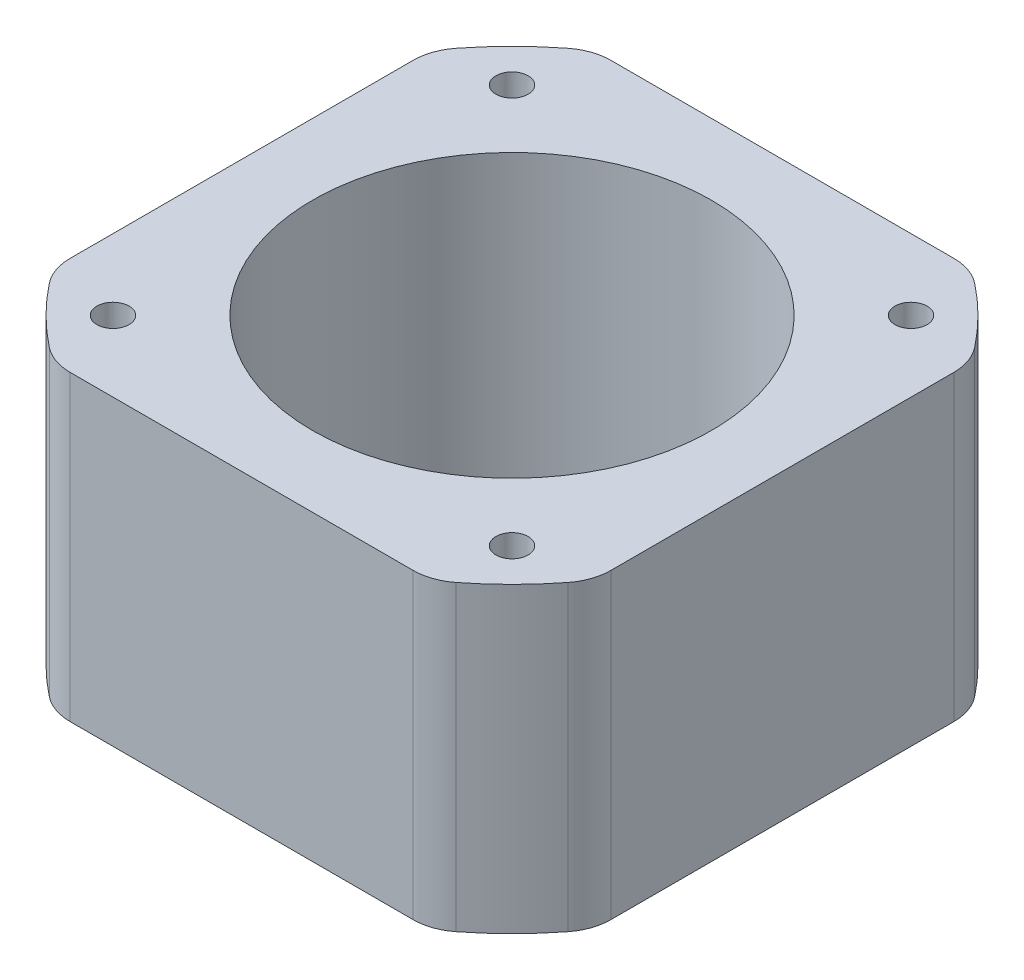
ISO-10303-21;
HEADER;
FILE_DESCRIPTION(('STEP AP214'),'2;1');
FILE_NAME('part.step','',(''),(''),'','','');
FILE_SCHEMA(('AUTOMOTIVE_DESIGN { 1 0 10303 214 1 1 1 1 }'));
ENDSEC;
DATA;
#1=APPLICATION_CONTEXT('core data for automotive mechanical design processes');
#2=APPLICATION_PROTOCOL_DEFINITION('international standard','automotive_design',2000,#1);
#3=PRODUCT_CONTEXT('',#1,'mechanical');
#4=PRODUCT('Part','Part','',(#3));
#5=PRODUCT_RELATED_PRODUCT_CATEGORY('part','',(#4));
#6=PRODUCT_DEFINITION_FORMATION('','',#4);
#7=PRODUCT_DEFINITION_CONTEXT('part definition',#1,'design');
#8=PRODUCT_DEFINITION('design','',#6,#7);
#9=PRODUCT_DEFINITION_SHAPE('','',#8);
#10=(LENGTH_UNIT() NAMED_UNIT(*) SI_UNIT(.MILLI.,.METRE.));
#11=(NAMED_UNIT(*) PLANE_ANGLE_UNIT() SI_UNIT($,.RADIAN.));
#12=(NAMED_UNIT(*) SI_UNIT($,.STERADIAN.) SOLID_ANGLE_UNIT());
#13=UNCERTAINTY_MEASURE_WITH_UNIT(LENGTH_MEASURE(1.E-05),#10,'distance_accuracy_value','');
#14=(GEOMETRIC_REPRESENTATION_CONTEXT(3) GLOBAL_UNCERTAINTY_ASSIGNED_CONTEXT((#13)) GLOBAL_UNIT_ASSIGNED_CONTEXT((#10,
#11,#12)) REPRESENTATION_CONTEXT('',''));
#15=CARTESIAN_POINT('',(0.,0.,0.));
#16=DIRECTION('',(0.,0.,1.));
#17=DIRECTION('',(1.,0.,0.));
#18=AXIS2_PLACEMENT_3D('',#15,#16,#17);
#19=CARTESIAN_POINT('',(0.,23.5,0.));
#20=DIRECTION('',(0.,1.,0.));
#21=DIRECTION('',(0.,0.,1.));
#22=AXIS2_PLACEMENT_3D('',#19,#20,#21);
#23=PLANE('',#22);
#24=CARTESIAN_POINT('',(15.5,23.5,15.5));
#25=DIRECTION('',(0.,1.,0.));
#26=DIRECTION('',(0.,0.,1.));
#27=AXIS2_PLACEMENT_3D('',#24,#25,#26);
#28=CIRCLE('',#27,1.25000000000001);
#29=CARTESIAN_POINT('',(15.5,23.5,16.75));
#30=VERTEX_POINT('',#29);
#31=EDGE_CURVE('E319',#30,#30,#28,.T.);
#32=ORIENTED_EDGE('',*,*,#31,.F.);
#33=EDGE_LOOP('',(#32));
#34=FACE_BOUND('',#33,.T.);
#35=CARTESIAN_POINT('',(-15.5,23.5,-15.5));
#36=DIRECTION('',(0.,1.,0.));
#37=DIRECTION('',(0.,0.,1.));
#38=AXIS2_PLACEMENT_3D('',#35,#36,#37);
#39=CIRCLE('',#38,1.25000000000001);
#40=CARTESIAN_POINT('',(-15.5,23.5,-14.25));
#41=VERTEX_POINT('',#40);
#42=EDGE_CURVE('E307',#41,#41,#39,.T.);
#43=ORIENTED_EDGE('',*,*,#42,.F.);
#44=EDGE_LOOP('',(#43));
#45=FACE_BOUND('',#44,.T.);
#46=CARTESIAN_POINT('',(0.,23.5,0.));
#47=DIRECTION('',(0.,1.,0.));
#48=DIRECTION('',(0.,0.,1.));
#49=AXIS2_PLACEMENT_3D('',#46,#47,#48);
#50=CIRCLE('',#49,25.6);
#51=CARTESIAN_POINT('',(-15.7927871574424,23.5,-20.1481481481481));
#52=VERTEX_POINT('',#51);
#53=CARTESIAN_POINT('',(-20.1481481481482,23.5,-15.7927871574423));
#54=VERTEX_POINT('',#53);
#55=EDGE_CURVE('E295',#52,#54,#50,.T.);
#56=ORIENTED_EDGE('',*,*,#55,.T.);
#57=CARTESIAN_POINT('',(-17.,23.5,-13.325164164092));
#58=DIRECTION('',(0.,1.,0.));
#59=DIRECTION('',(0.,0.,1.));
#60=AXIS2_PLACEMENT_3D('',#57,#58,#59);
#61=CIRCLE('',#60,4.);
#62=CARTESIAN_POINT('',(-21.,23.5,-13.325164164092));
#63=VERTEX_POINT('',#62);
#64=EDGE_CURVE('E223',#54,#63,#61,.T.);
#65=ORIENTED_EDGE('',*,*,#64,.T.);
#66=DIRECTION('',(0.,0.,1.));
#67=VECTOR('',#66,1.);
#68=CARTESIAN_POINT('',(-21.,23.5,14.641038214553));
#69=LINE('',#68,#67);
#70=CARTESIAN_POINT('',(-21.,23.5,13.325164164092));
#71=VERTEX_POINT('',#70);
#72=EDGE_CURVE('E168',#63,#71,#69,.T.);
#73=ORIENTED_EDGE('',*,*,#72,.T.);
#74=CARTESIAN_POINT('',(-17.,23.5,13.325164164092));
#75=DIRECTION('',(0.,1.,0.));
#76=DIRECTION('',(0.,0.,1.));
#77=AXIS2_PLACEMENT_3D('',#74,#75,#76);
#78=CIRCLE('',#77,4.);
#79=CARTESIAN_POINT('',(-20.1481481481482,23.5,15.7927871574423));
#80=VERTEX_POINT('',#79);
#81=EDGE_CURVE('E210',#71,#80,#78,.T.);
#82=ORIENTED_EDGE('',*,*,#81,.T.);
#83=CARTESIAN_POINT('',(0.,23.5,0.));
#84=DIRECTION('',(0.,1.,0.));
#85=DIRECTION('',(0.,0.,1.));
#86=AXIS2_PLACEMENT_3D('',#83,#84,#85);
#87=CIRCLE('',#86,25.6);
#88=CARTESIAN_POINT('',(-15.7927871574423,23.5,20.1481481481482));
#89=VERTEX_POINT('',#88);
#90=EDGE_CURVE('E255',#80,#89,#87,.T.);
#91=ORIENTED_EDGE('',*,*,#90,.T.);
#92=CARTESIAN_POINT('',(-13.325164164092,23.5,17.));
#93=DIRECTION('',(0.,1.,0.));
#94=DIRECTION('',(0.,0.,1.));
#95=AXIS2_PLACEMENT_3D('',#92,#93,#94);
#96=CIRCLE('',#95,4.);
#97=CARTESIAN_POINT('',(-13.325164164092,23.5,21.));
#98=VERTEX_POINT('',#97);
#99=EDGE_CURVE('E212',#89,#98,#96,.T.);
#100=ORIENTED_EDGE('',*,*,#99,.T.);
#101=DIRECTION('',(1.,0.,0.));
#102=VECTOR('',#101,1.);
#103=CARTESIAN_POINT('',(-14.641038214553,23.5,21.));
#104=LINE('',#103,#102);
#105=CARTESIAN_POINT('',(13.3251641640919,23.5,21.));
#106=VERTEX_POINT('',#105);
#107=EDGE_CURVE('E268',#98,#106,#104,.T.);
#108=ORIENTED_EDGE('',*,*,#107,.T.);
#109=CARTESIAN_POINT('',(13.3251641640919,23.5,17.));
#110=DIRECTION('',(0.,1.,0.));
#111=DIRECTION('',(0.,0.,1.));
#112=AXIS2_PLACEMENT_3D('',#109,#110,#111);
#113=CIRCLE('',#112,4.);
#114=CARTESIAN_POINT('',(15.7927871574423,23.5,20.1481481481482));
#115=VERTEX_POINT('',#114);
#116=EDGE_CURVE('E214',#106,#115,#113,.T.);
#117=ORIENTED_EDGE('',*,*,#116,.T.);
#118=CARTESIAN_POINT('',(0.,23.5,0.));
#119=DIRECTION('',(0.,1.,0.));
#120=DIRECTION('',(0.,0.,1.));
#121=AXIS2_PLACEMENT_3D('',#118,#119,#120);
#122=CIRCLE('',#121,25.6);
#123=CARTESIAN_POINT('',(20.1481481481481,23.5,15.7927871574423));
#124=VERTEX_POINT('',#123);
#125=EDGE_CURVE('E270',#115,#124,#122,.T.);
#126=ORIENTED_EDGE('',*,*,#125,.T.);
#127=CARTESIAN_POINT('',(17.,23.5,13.3251641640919));
#128=DIRECTION('',(0.,1.,0.));
#129=DIRECTION('',(0.,0.,1.));
#130=AXIS2_PLACEMENT_3D('',#127,#128,#129);
#131=CIRCLE('',#130,4.);
#132=CARTESIAN_POINT('',(21.,23.5,13.3251641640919));
#133=VERTEX_POINT('',#132);
#134=EDGE_CURVE('E56',#124,#133,#131,.T.);
#135=ORIENTED_EDGE('',*,*,#134,.T.);
#136=DIRECTION('',(0.,0.,-1.));
#137=VECTOR('',#136,1.);
#138=CARTESIAN_POINT('',(21.,23.5,14.641038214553));
#139=LINE('',#138,#137);
#140=CARTESIAN_POINT('',(21.,23.5,-13.3251641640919));
#141=VERTEX_POINT('',#140);
#142=EDGE_CURVE('E193',#133,#141,#139,.T.);
#143=ORIENTED_EDGE('',*,*,#142,.T.);
#144=CARTESIAN_POINT('',(17.,23.5,-13.3251641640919));
#145=DIRECTION('',(0.,1.,0.));
#146=DIRECTION('',(0.,0.,1.));
#147=AXIS2_PLACEMENT_3D('',#144,#145,#146);
#148=CIRCLE('',#147,4.);
#149=CARTESIAN_POINT('',(20.1481481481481,23.5,-15.7927871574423));
#150=VERTEX_POINT('',#149);
#151=EDGE_CURVE('E217',#141,#150,#148,.T.);
#152=ORIENTED_EDGE('',*,*,#151,.T.);
#153=CARTESIAN_POINT('',(0.,23.5,0.));
#154=DIRECTION('',(0.,1.,0.));
#155=DIRECTION('',(0.,0.,1.));
#156=AXIS2_PLACEMENT_3D('',#153,#154,#155);
#157=CIRCLE('',#156,25.6);
#158=CARTESIAN_POINT('',(15.7927871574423,23.5,-20.1481481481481));
#159=VERTEX_POINT('',#158);
#160=EDGE_CURVE('E192',#150,#159,#157,.T.);
#161=ORIENTED_EDGE('',*,*,#160,.T.);
#162=CARTESIAN_POINT('',(13.3251641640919,23.5,-17.));
#163=DIRECTION('',(0.,1.,0.));
#164=DIRECTION('',(0.,0.,1.));
#165=AXIS2_PLACEMENT_3D('',#162,#163,#164);
#166=CIRCLE('',#165,4.);
#167=CARTESIAN_POINT('',(13.3251641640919,23.5,-21.));
#168=VERTEX_POINT('',#167);
#169=EDGE_CURVE('E219',#159,#168,#166,.T.);
#170=ORIENTED_EDGE('',*,*,#169,.T.);
#171=DIRECTION('',(-1.,0.,0.));
#172=VECTOR('',#171,1.);
#173=CARTESIAN_POINT('',(-14.641038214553,23.5,-21.));
#174=LINE('',#173,#172);
#175=CARTESIAN_POINT('',(-13.325164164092,23.5,-21.));
#176=VERTEX_POINT('',#175);
#177=EDGE_CURVE('E296',#168,#176,#174,.T.);
#178=ORIENTED_EDGE('',*,*,#177,.T.);
#179=CARTESIAN_POINT('',(-13.325164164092,23.5,-17.));
#180=DIRECTION('',(0.,1.,0.));
#181=DIRECTION('',(0.,0.,1.));
#182=AXIS2_PLACEMENT_3D('',#179,#180,#181);
#183=CIRCLE('',#182,4.);
#184=EDGE_CURVE('E221',#176,#52,#183,.T.);
#185=ORIENTED_EDGE('',*,*,#184,.T.);
#186=EDGE_LOOP('',(#56,#65,#73,#82,#91,#100,#108,#117,#126,#135,#143,#152,#161,#170,#178,#185));
#187=FACE_BOUND('',#186,.T.);
#188=CARTESIAN_POINT('',(0.,23.5,0.));
#189=DIRECTION('',(0.,1.,0.));
#190=DIRECTION('',(0.,0.,1.));
#191=AXIS2_PLACEMENT_3D('',#188,#189,#190);
#192=CIRCLE('',#191,15.5);
#193=CARTESIAN_POINT('',(0.,23.5,15.5));
#194=VERTEX_POINT('',#193);
#195=EDGE_CURVE('E279',#194,#194,#192,.T.);
#196=ORIENTED_EDGE('',*,*,#195,.F.);
#197=EDGE_LOOP('',(#196));
#198=FACE_BOUND('',#197,.T.);
#199=CARTESIAN_POINT('',(15.5,23.5,-15.5));
#200=DIRECTION('',(0.,1.,0.));
#201=DIRECTION('',(0.,0.,1.));
#202=AXIS2_PLACEMENT_3D('',#199,#200,#201);
#203=CIRCLE('',#202,1.25000000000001);
#204=CARTESIAN_POINT('',(15.5,23.5,-14.25));
#205=VERTEX_POINT('',#204);
#206=EDGE_CURVE('E313',#205,#205,#203,.T.);
#207=ORIENTED_EDGE('',*,*,#206,.F.);
#208=EDGE_LOOP('',(#207));
#209=FACE_BOUND('',#208,.T.);
#210=CARTESIAN_POINT('',(-15.5,23.5,15.5));
#211=DIRECTION('',(0.,1.,0.));
#212=DIRECTION('',(0.,0.,1.));
#213=AXIS2_PLACEMENT_3D('',#210,#211,#212);
#214=CIRCLE('',#213,1.25000000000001);
#215=CARTESIAN_POINT('',(-15.5,23.5,16.75));
#216=VERTEX_POINT('',#215);
#217=EDGE_CURVE('E325',#216,#216,#214,.T.);
#218=ORIENTED_EDGE('',*,*,#217,.F.);
#219=EDGE_LOOP('',(#218));
#220=FACE_BOUND('',#219,.T.);
#221=ADVANCED_FACE('F34',(#34,#45,#187,#198,#209,#220),#23,.T.);
#222=CARTESIAN_POINT('',(0.,0.,0.));
#223=DIRECTION('',(0.,1.,0.));
#224=DIRECTION('',(0.,0.,1.));
#225=AXIS2_PLACEMENT_3D('',#222,#223,#224);
#226=PLANE('',#225);
#227=DIRECTION('',(0.,0.,1.));
#228=VECTOR('',#227,1.);
#229=CARTESIAN_POINT('',(-21.,0.,14.641038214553));
#230=LINE('',#229,#228);
#231=CARTESIAN_POINT('',(-21.,0.,-13.325164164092));
#232=VERTEX_POINT('',#231);
#233=CARTESIAN_POINT('',(-21.,0.,13.325164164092));
#234=VERTEX_POINT('',#233);
#235=EDGE_CURVE('E165',#232,#234,#230,.T.);
#236=ORIENTED_EDGE('',*,*,#235,.F.);
#237=CARTESIAN_POINT('',(-17.,0.,-13.325164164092));
#238=DIRECTION('',(0.,1.,0.));
#239=DIRECTION('',(0.,0.,1.));
#240=AXIS2_PLACEMENT_3D('',#237,#238,#239);
#241=CIRCLE('',#240,4.);
#242=CARTESIAN_POINT('',(-20.1481481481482,0.,-15.7927871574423));
#243=VERTEX_POINT('',#242);
#244=EDGE_CURVE('E148',#232,#243,#241,.F.);
#245=ORIENTED_EDGE('',*,*,#244,.T.);
#246=CARTESIAN_POINT('',(0.,0.,0.));
#247=DIRECTION('',(0.,1.,0.));
#248=DIRECTION('',(0.,0.,1.));
#249=AXIS2_PLACEMENT_3D('',#246,#247,#248);
#250=CIRCLE('',#249,25.6);
#251=CARTESIAN_POINT('',(-15.7927871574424,0.,-20.1481481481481));
#252=VERTEX_POINT('',#251);
#253=EDGE_CURVE('E176',#252,#243,#250,.T.);
#254=ORIENTED_EDGE('',*,*,#253,.F.);
#255=CARTESIAN_POINT('',(-13.325164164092,0.,-17.));
#256=DIRECTION('',(0.,1.,0.));
#257=DIRECTION('',(0.,0.,1.));
#258=AXIS2_PLACEMENT_3D('',#255,#256,#257);
#259=CIRCLE('',#258,4.);
#260=CARTESIAN_POINT('',(-13.325164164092,0.,-21.));
#261=VERTEX_POINT('',#260);
#262=EDGE_CURVE('E159',#252,#261,#259,.F.);
#263=ORIENTED_EDGE('',*,*,#262,.T.);
#264=DIRECTION('',(-1.,0.,0.));
#265=VECTOR('',#264,1.);
#266=CARTESIAN_POINT('',(-14.641038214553,0.,-21.));
#267=LINE('',#266,#265);
#268=CARTESIAN_POINT('',(13.3251641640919,0.,-21.));
#269=VERTEX_POINT('',#268);
#270=EDGE_CURVE('E181',#269,#261,#267,.T.);
#271=ORIENTED_EDGE('',*,*,#270,.F.);
#272=CARTESIAN_POINT('',(13.3251641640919,0.,-17.));
#273=DIRECTION('',(0.,1.,0.));
#274=DIRECTION('',(0.,0.,1.));
#275=AXIS2_PLACEMENT_3D('',#272,#273,#274);
#276=CIRCLE('',#275,4.);
#277=CARTESIAN_POINT('',(15.7927871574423,0.,-20.1481481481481));
#278=VERTEX_POINT('',#277);
#279=EDGE_CURVE('E204',#269,#278,#276,.F.);
#280=ORIENTED_EDGE('',*,*,#279,.T.);
#281=CARTESIAN_POINT('',(0.,0.,0.));
#282=DIRECTION('',(0.,1.,0.));
#283=DIRECTION('',(0.,0.,1.));
#284=AXIS2_PLACEMENT_3D('',#281,#282,#283);
#285=CIRCLE('',#284,25.6);
#286=CARTESIAN_POINT('',(20.1481481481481,0.,-15.7927871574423));
#287=VERTEX_POINT('',#286);
#288=EDGE_CURVE('E277',#287,#278,#285,.T.);
#289=ORIENTED_EDGE('',*,*,#288,.F.);
#290=CARTESIAN_POINT('',(17.,0.,-13.3251641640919));
#291=DIRECTION('',(0.,1.,0.));
#292=DIRECTION('',(0.,0.,1.));
#293=AXIS2_PLACEMENT_3D('',#290,#291,#292);
#294=CIRCLE('',#293,4.);
#295=CARTESIAN_POINT('',(21.,0.,-13.3251641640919));
#296=VERTEX_POINT('',#295);
#297=EDGE_CURVE('E202',#287,#296,#294,.F.);
#298=ORIENTED_EDGE('',*,*,#297,.T.);
#299=DIRECTION('',(0.,0.,-1.));
#300=VECTOR('',#299,1.);
#301=CARTESIAN_POINT('',(21.,0.,14.641038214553));
#302=LINE('',#301,#300);
#303=CARTESIAN_POINT('',(21.,0.,13.3251641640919));
#304=VERTEX_POINT('',#303);
#305=EDGE_CURVE('E190',#304,#296,#302,.T.);
#306=ORIENTED_EDGE('',*,*,#305,.F.);
#307=CARTESIAN_POINT('',(17.,0.,13.3251641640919));
#308=DIRECTION('',(0.,1.,0.));
#309=DIRECTION('',(0.,0.,1.));
#310=AXIS2_PLACEMENT_3D('',#307,#308,#309);
#311=CIRCLE('',#310,4.);
#312=CARTESIAN_POINT('',(20.1481481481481,0.,15.7927871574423));
#313=VERTEX_POINT('',#312);
#314=EDGE_CURVE('E200',#304,#313,#311,.F.);
#315=ORIENTED_EDGE('',*,*,#314,.T.);
#316=CARTESIAN_POINT('',(0.,0.,0.));
#317=DIRECTION('',(0.,1.,0.));
#318=DIRECTION('',(0.,0.,1.));
#319=AXIS2_PLACEMENT_3D('',#316,#317,#318);
#320=CIRCLE('',#319,25.6);
#321=CARTESIAN_POINT('',(15.7927871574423,0.,20.1481481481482));
#322=VERTEX_POINT('',#321);
#323=EDGE_CURVE('E187',#322,#313,#320,.T.);
#324=ORIENTED_EDGE('',*,*,#323,.F.);
#325=CARTESIAN_POINT('',(13.3251641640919,0.,17.));
#326=DIRECTION('',(0.,1.,0.));
#327=DIRECTION('',(0.,0.,1.));
#328=AXIS2_PLACEMENT_3D('',#325,#326,#327);
#329=CIRCLE('',#328,4.);
#330=CARTESIAN_POINT('',(13.3251641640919,0.,21.));
#331=VERTEX_POINT('',#330);
#332=EDGE_CURVE('E198',#322,#331,#329,.F.);
#333=ORIENTED_EDGE('',*,*,#332,.T.);
#334=DIRECTION('',(1.,0.,0.));
#335=VECTOR('',#334,1.);
#336=CARTESIAN_POINT('',(-14.641038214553,0.,21.));
#337=LINE('',#336,#335);
#338=CARTESIAN_POINT('',(-13.325164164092,0.,21.));
#339=VERTEX_POINT('',#338);
#340=EDGE_CURVE('E179',#339,#331,#337,.T.);
#341=ORIENTED_EDGE('',*,*,#340,.F.);
#342=CARTESIAN_POINT('',(-13.325164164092,0.,17.));
#343=DIRECTION('',(0.,1.,0.));
#344=DIRECTION('',(0.,0.,1.));
#345=AXIS2_PLACEMENT_3D('',#342,#343,#344);
#346=CIRCLE('',#345,4.);
#347=CARTESIAN_POINT('',(-15.7927871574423,0.,20.1481481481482));
#348=VERTEX_POINT('',#347);
#349=EDGE_CURVE('E196',#339,#348,#346,.F.);
#350=ORIENTED_EDGE('',*,*,#349,.T.);
#351=CARTESIAN_POINT('',(0.,0.,0.));
#352=DIRECTION('',(0.,1.,0.));
#353=DIRECTION('',(0.,0.,1.));
#354=AXIS2_PLACEMENT_3D('',#351,#352,#353);
#355=CIRCLE('',#354,25.6);
#356=CARTESIAN_POINT('',(-20.1481481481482,0.,15.7927871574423));
#357=VERTEX_POINT('',#356);
#358=EDGE_CURVE('E175',#357,#348,#355,.T.);
#359=ORIENTED_EDGE('',*,*,#358,.F.);
#360=CARTESIAN_POINT('',(-17.,0.,13.325164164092));
#361=DIRECTION('',(0.,1.,0.));
#362=DIRECTION('',(0.,0.,1.));
#363=AXIS2_PLACEMENT_3D('',#360,#361,#362);
#364=CIRCLE('',#363,4.);
#365=EDGE_CURVE('E169',#357,#234,#364,.F.);
#366=ORIENTED_EDGE('',*,*,#365,.T.);
#367=EDGE_LOOP('',(#236,#245,#254,#263,#271,#280,#289,#298,#306,#315,#324,#333,#341,#350,#359,#366));
#368=FACE_BOUND('',#367,.T.);
#369=CARTESIAN_POINT('',(0.,0.,0.));
#370=DIRECTION('',(0.,1.,0.));
#371=DIRECTION('',(0.,0.,1.));
#372=AXIS2_PLACEMENT_3D('',#369,#370,#371);
#373=CIRCLE('',#372,15.5);
#374=CARTESIAN_POINT('',(0.,0.,15.5));
#375=VERTEX_POINT('',#374);
#376=EDGE_CURVE('E304',#375,#375,#373,.T.);
#377=ORIENTED_EDGE('',*,*,#376,.T.);
#378=EDGE_LOOP('',(#377));
#379=FACE_BOUND('',#378,.T.);
#380=CARTESIAN_POINT('',(-15.5,0.,-15.5));
#381=DIRECTION('',(0.,1.,0.));
#382=DIRECTION('',(0.,0.,1.));
#383=AXIS2_PLACEMENT_3D('',#380,#381,#382);
#384=CIRCLE('',#383,1.25000000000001);
#385=CARTESIAN_POINT('',(-15.5,0.,-14.25));
#386=VERTEX_POINT('',#385);
#387=EDGE_CURVE('E310',#386,#386,#384,.T.);
#388=ORIENTED_EDGE('',*,*,#387,.T.);
#389=EDGE_LOOP('',(#388));
#390=FACE_BOUND('',#389,.T.);
#391=CARTESIAN_POINT('',(15.5,0.,-15.5));
#392=DIRECTION('',(0.,1.,0.));
#393=DIRECTION('',(0.,0.,1.));
#394=AXIS2_PLACEMENT_3D('',#391,#392,#393);
#395=CIRCLE('',#394,1.25000000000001);
#396=CARTESIAN_POINT('',(15.5,0.,-14.25));
#397=VERTEX_POINT('',#396);
#398=EDGE_CURVE('E316',#397,#397,#395,.T.);
#399=ORIENTED_EDGE('',*,*,#398,.T.);
#400=EDGE_LOOP('',(#399));
#401=FACE_BOUND('',#400,.T.);
#402=CARTESIAN_POINT('',(15.5,0.,15.5));
#403=DIRECTION('',(0.,1.,0.));
#404=DIRECTION('',(0.,0.,1.));
#405=AXIS2_PLACEMENT_3D('',#402,#403,#404);
#406=CIRCLE('',#405,1.25000000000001);
#407=CARTESIAN_POINT('',(15.5,0.,16.75));
#408=VERTEX_POINT('',#407);
#409=EDGE_CURVE('E322',#408,#408,#406,.T.);
#410=ORIENTED_EDGE('',*,*,#409,.T.);
#411=EDGE_LOOP('',(#410));
#412=FACE_BOUND('',#411,.T.);
#413=CARTESIAN_POINT('',(-15.5,0.,15.5));
#414=DIRECTION('',(0.,1.,0.));
#415=DIRECTION('',(0.,0.,1.));
#416=AXIS2_PLACEMENT_3D('',#413,#414,#415);
#417=CIRCLE('',#416,1.25000000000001);
#418=CARTESIAN_POINT('',(-15.5,0.,16.75));
#419=VERTEX_POINT('',#418);
#420=EDGE_CURVE('E328',#419,#419,#417,.T.);
#421=ORIENTED_EDGE('',*,*,#420,.T.);
#422=EDGE_LOOP('',(#421));
#423=FACE_BOUND('',#422,.T.);
#424=ADVANCED_FACE('F172',(#368,#379,#390,#401,#412,#423),#226,.F.);
#425=CARTESIAN_POINT('',(0.,23.5,0.));
#426=DIRECTION('',(0.,-1.,0.));
#427=DIRECTION('',(0.,0.,-1.));
#428=AXIS2_PLACEMENT_3D('',#425,#426,#427);
#429=CYLINDRICAL_SURFACE('',#428,25.6);
#430=ORIENTED_EDGE('',*,*,#288,.T.);
#431=DIRECTION('',(0.,-1.,0.));
#432=VECTOR('',#431,1.);
#433=CARTESIAN_POINT('',(15.7927871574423,23.5,-20.1481481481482));
#434=LINE('',#433,#432);
#435=EDGE_CURVE('E233',#278,#159,#434,.F.);
#436=ORIENTED_EDGE('',*,*,#435,.T.);
#437=ORIENTED_EDGE('',*,*,#160,.F.);
#438=DIRECTION('',(0.,-1.,0.));
#439=VECTOR('',#438,1.);
#440=CARTESIAN_POINT('',(20.1481481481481,23.5,-15.7927871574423));
#441=LINE('',#440,#439);
#442=EDGE_CURVE('E230',#150,#287,#441,.T.);
#443=ORIENTED_EDGE('',*,*,#442,.T.);
#444=EDGE_LOOP('',(#430,#436,#437,#443));
#445=FACE_BOUND('',#444,.T.);
#446=ADVANCED_FACE('F343',(#445),#429,.T.);
#447=CARTESIAN_POINT('',(-14.641038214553,23.5,-21.));
#448=DIRECTION('',(0.,0.,1.));
#449=DIRECTION('',(1.,0.,0.));
#450=AXIS2_PLACEMENT_3D('',#447,#448,#449);
#451=PLANE('',#450);
#452=ORIENTED_EDGE('',*,*,#270,.T.);
#453=DIRECTION('',(0.,-1.,0.));
#454=VECTOR('',#453,1.);
#455=CARTESIAN_POINT('',(-13.325164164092,23.5,-21.));
#456=LINE('',#455,#454);
#457=EDGE_CURVE('E228',#261,#176,#456,.F.);
#458=ORIENTED_EDGE('',*,*,#457,.T.);
#459=ORIENTED_EDGE('',*,*,#177,.F.);
#460=DIRECTION('',(0.,-1.,0.));
#461=VECTOR('',#460,1.);
#462=CARTESIAN_POINT('',(13.3251641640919,23.5,-21.));
#463=LINE('',#462,#461);
#464=EDGE_CURVE('E225',#168,#269,#463,.T.);
#465=ORIENTED_EDGE('',*,*,#464,.T.);
#466=EDGE_LOOP('',(#452,#458,#459,#465));
#467=FACE_BOUND('',#466,.T.);
#468=ADVANCED_FACE('F284',(#467),#451,.F.);
#469=CARTESIAN_POINT('',(0.,23.5,0.));
#470=DIRECTION('',(0.,-1.,0.));
#471=DIRECTION('',(0.,0.,-1.));
#472=AXIS2_PLACEMENT_3D('',#469,#470,#471);
#473=CYLINDRICAL_SURFACE('',#472,25.6);
#474=ORIENTED_EDGE('',*,*,#253,.T.);
#475=DIRECTION('',(0.,-1.,0.));
#476=VECTOR('',#475,1.);
#477=CARTESIAN_POINT('',(-20.1481481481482,23.5,-15.7927871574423));
#478=LINE('',#477,#476);
#479=EDGE_CURVE('E153',#243,#54,#478,.F.);
#480=ORIENTED_EDGE('',*,*,#479,.T.);
#481=ORIENTED_EDGE('',*,*,#55,.F.);
#482=DIRECTION('',(0.,-1.,0.));
#483=VECTOR('',#482,1.);
#484=CARTESIAN_POINT('',(-15.7927871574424,23.5,-20.1481481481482));
#485=LINE('',#484,#483);
#486=EDGE_CURVE('E158',#52,#252,#485,.T.);
#487=ORIENTED_EDGE('',*,*,#486,.T.);
#488=EDGE_LOOP('',(#474,#480,#481,#487));
#489=FACE_BOUND('',#488,.T.);
#490=ADVANCED_FACE('F298',(#489),#473,.T.);
#491=CARTESIAN_POINT('',(-21.,23.5,14.641038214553));
#492=DIRECTION('',(1.,0.,0.));
#493=DIRECTION('',(0.,0.,-1.));
#494=AXIS2_PLACEMENT_3D('',#491,#492,#493);
#495=PLANE('',#494);
#496=ORIENTED_EDGE('',*,*,#72,.F.);
#497=DIRECTION('',(0.,-1.,0.));
#498=VECTOR('',#497,1.);
#499=CARTESIAN_POINT('',(-21.,23.5,-13.325164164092));
#500=LINE('',#499,#498);
#501=EDGE_CURVE('E152',#63,#232,#500,.T.);
#502=ORIENTED_EDGE('',*,*,#501,.T.);
#503=ORIENTED_EDGE('',*,*,#235,.T.);
#504=DIRECTION('',(0.,-1.,0.));
#505=VECTOR('',#504,1.);
#506=CARTESIAN_POINT('',(-21.,23.5,13.325164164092));
#507=LINE('',#506,#505);
#508=EDGE_CURVE('E170',#234,#71,#507,.F.);
#509=ORIENTED_EDGE('',*,*,#508,.T.);
#510=EDGE_LOOP('',(#496,#502,#503,#509));
#511=FACE_BOUND('',#510,.T.);
#512=ADVANCED_FACE('F164',(#511),#495,.F.);
#513=CARTESIAN_POINT('',(0.,23.5,0.));
#514=DIRECTION('',(0.,-1.,0.));
#515=DIRECTION('',(0.,0.,-1.));
#516=AXIS2_PLACEMENT_3D('',#513,#514,#515);
#517=CYLINDRICAL_SURFACE('',#516,25.6);
#518=ORIENTED_EDGE('',*,*,#358,.T.);
#519=DIRECTION('',(0.,-1.,0.));
#520=VECTOR('',#519,1.);
#521=CARTESIAN_POINT('',(-15.7927871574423,23.5,20.1481481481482));
#522=LINE('',#521,#520);
#523=EDGE_CURVE('E11',#348,#89,#522,.F.);
#524=ORIENTED_EDGE('',*,*,#523,.T.);
#525=ORIENTED_EDGE('',*,*,#90,.F.);
#526=DIRECTION('',(0.,-1.,0.));
#527=VECTOR('',#526,1.);
#528=CARTESIAN_POINT('',(-20.1481481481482,23.5,15.7927871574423));
#529=LINE('',#528,#527);
#530=EDGE_CURVE('E42',#80,#357,#529,.T.);
#531=ORIENTED_EDGE('',*,*,#530,.T.);
#532=EDGE_LOOP('',(#518,#524,#525,#531));
#533=FACE_BOUND('',#532,.T.);
#534=ADVANCED_FACE('F252',(#533),#517,.T.);
#535=CARTESIAN_POINT('',(-14.641038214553,23.5,21.));
#536=DIRECTION('',(0.,0.,-1.));
#537=DIRECTION('',(-1.,0.,0.));
#538=AXIS2_PLACEMENT_3D('',#535,#536,#537);
#539=PLANE('',#538);
#540=ORIENTED_EDGE('',*,*,#340,.T.);
#541=DIRECTION('',(0.,-1.,0.));
#542=VECTOR('',#541,1.);
#543=CARTESIAN_POINT('',(13.3251641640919,23.5,21.));
#544=LINE('',#543,#542);
#545=EDGE_CURVE('E247',#331,#106,#544,.F.);
#546=ORIENTED_EDGE('',*,*,#545,.T.);
#547=ORIENTED_EDGE('',*,*,#107,.F.);
#548=DIRECTION('',(0.,-1.,0.));
#549=VECTOR('',#548,1.);
#550=CARTESIAN_POINT('',(-13.325164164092,23.5,21.));
#551=LINE('',#550,#549);
#552=EDGE_CURVE('E244',#98,#339,#551,.T.);
#553=ORIENTED_EDGE('',*,*,#552,.T.);
#554=EDGE_LOOP('',(#540,#546,#547,#553));
#555=FACE_BOUND('',#554,.T.);
#556=ADVANCED_FACE('F265',(#555),#539,.F.);
#557=CARTESIAN_POINT('',(0.,23.5,0.));
#558=DIRECTION('',(0.,-1.,0.));
#559=DIRECTION('',(0.,0.,-1.));
#560=AXIS2_PLACEMENT_3D('',#557,#558,#559);
#561=CYLINDRICAL_SURFACE('',#560,25.6);
#562=ORIENTED_EDGE('',*,*,#323,.T.);
#563=DIRECTION('',(0.,-1.,0.));
#564=VECTOR('',#563,1.);
#565=CARTESIAN_POINT('',(20.1481481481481,23.5,15.7927871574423));
#566=LINE('',#565,#564);
#567=EDGE_CURVE('E242',#313,#124,#566,.F.);
#568=ORIENTED_EDGE('',*,*,#567,.T.);
#569=ORIENTED_EDGE('',*,*,#125,.F.);
#570=DIRECTION('',(0.,-1.,0.));
#571=VECTOR('',#570,1.);
#572=CARTESIAN_POINT('',(15.7927871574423,23.5,20.1481481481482));
#573=LINE('',#572,#571);
#574=EDGE_CURVE('E239',#115,#322,#573,.T.);
#575=ORIENTED_EDGE('',*,*,#574,.T.);
#576=EDGE_LOOP('',(#562,#568,#569,#575));
#577=FACE_BOUND('',#576,.T.);
#578=ADVANCED_FACE('F354',(#577),#561,.T.);
#579=CARTESIAN_POINT('',(21.,23.5,14.641038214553));
#580=DIRECTION('',(-1.,0.,0.));
#581=DIRECTION('',(0.,0.,1.));
#582=AXIS2_PLACEMENT_3D('',#579,#580,#581);
#583=PLANE('',#582);
#584=ORIENTED_EDGE('',*,*,#305,.T.);
#585=DIRECTION('',(0.,-1.,0.));
#586=VECTOR('',#585,1.);
#587=CARTESIAN_POINT('',(21.,23.5,-13.3251641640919));
#588=LINE('',#587,#586);
#589=EDGE_CURVE('E49',#296,#141,#588,.F.);
#590=ORIENTED_EDGE('',*,*,#589,.T.);
#591=ORIENTED_EDGE('',*,*,#142,.F.);
#592=DIRECTION('',(0.,-1.,0.));
#593=VECTOR('',#592,1.);
#594=CARTESIAN_POINT('',(21.,23.5,13.3251641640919));
#595=LINE('',#594,#593);
#596=EDGE_CURVE('E235',#133,#304,#595,.T.);
#597=ORIENTED_EDGE('',*,*,#596,.T.);
#598=EDGE_LOOP('',(#584,#590,#591,#597));
#599=FACE_BOUND('',#598,.T.);
#600=ADVANCED_FACE('F351',(#599),#583,.F.);
#601=CARTESIAN_POINT('',(0.,23.5,0.));
#602=DIRECTION('',(0.,-1.,0.));
#603=DIRECTION('',(0.,0.,-1.));
#604=AXIS2_PLACEMENT_3D('',#601,#602,#603);
#605=CYLINDRICAL_SURFACE('',#604,15.5);
#606=ORIENTED_EDGE('',*,*,#195,.T.);
#607=EDGE_LOOP('',(#606));
#608=FACE_BOUND('',#607,.T.);
#609=ORIENTED_EDGE('',*,*,#376,.F.);
#610=EDGE_LOOP('',(#609));
#611=FACE_BOUND('',#610,.T.);
#612=ADVANCED_FACE('F348',(#608,#611),#605,.F.);
#613=CARTESIAN_POINT('',(-15.5,23.5,-15.5));
#614=DIRECTION('',(0.,-1.,0.));
#615=DIRECTION('',(0.,0.,-1.));
#616=AXIS2_PLACEMENT_3D('',#613,#614,#615);
#617=CYLINDRICAL_SURFACE('',#616,1.25000000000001);
#618=ORIENTED_EDGE('',*,*,#42,.T.);
#619=EDGE_LOOP('',(#618));
#620=FACE_BOUND('',#619,.T.);
#621=ORIENTED_EDGE('',*,*,#387,.F.);
#622=EDGE_LOOP('',(#621));
#623=FACE_BOUND('',#622,.T.);
#624=ADVANCED_FACE('F524',(#620,#623),#617,.F.);
#625=CARTESIAN_POINT('',(15.5,23.5,-15.5));
#626=DIRECTION('',(0.,-1.,0.));
#627=DIRECTION('',(0.,0.,-1.));
#628=AXIS2_PLACEMENT_3D('',#625,#626,#627);
#629=CYLINDRICAL_SURFACE('',#628,1.25000000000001);
#630=ORIENTED_EDGE('',*,*,#206,.T.);
#631=EDGE_LOOP('',(#630));
#632=FACE_BOUND('',#631,.T.);
#633=ORIENTED_EDGE('',*,*,#398,.F.);
#634=EDGE_LOOP('',(#633));
#635=FACE_BOUND('',#634,.T.);
#636=ADVANCED_FACE('F514',(#632,#635),#629,.F.);
#637=CARTESIAN_POINT('',(15.5,23.5,15.5));
#638=DIRECTION('',(0.,-1.,0.));
#639=DIRECTION('',(0.,0.,-1.));
#640=AXIS2_PLACEMENT_3D('',#637,#638,#639);
#641=CYLINDRICAL_SURFACE('',#640,1.25000000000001);
#642=ORIENTED_EDGE('',*,*,#31,.T.);
#643=EDGE_LOOP('',(#642));
#644=FACE_BOUND('',#643,.T.);
#645=ORIENTED_EDGE('',*,*,#409,.F.);
#646=EDGE_LOOP('',(#645));
#647=FACE_BOUND('',#646,.T.);
#648=ADVANCED_FACE('F505',(#644,#647),#641,.F.);
#649=CARTESIAN_POINT('',(-15.5,23.5,15.5));
#650=DIRECTION('',(0.,-1.,0.));
#651=DIRECTION('',(0.,0.,-1.));
#652=AXIS2_PLACEMENT_3D('',#649,#650,#651);
#653=CYLINDRICAL_SURFACE('',#652,1.25000000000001);
#654=ORIENTED_EDGE('',*,*,#217,.T.);
#655=EDGE_LOOP('',(#654));
#656=FACE_BOUND('',#655,.T.);
#657=ORIENTED_EDGE('',*,*,#420,.F.);
#658=EDGE_LOOP('',(#657));
#659=FACE_BOUND('',#658,.T.);
#660=ADVANCED_FACE('F334',(#656,#659),#653,.F.);
#661=CARTESIAN_POINT('',(-17.,23.5,-13.325164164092));
#662=DIRECTION('',(0.,-1.,0.));
#663=DIRECTION('',(0.,0.,-1.));
#664=AXIS2_PLACEMENT_3D('',#661,#662,#663);
#665=CYLINDRICAL_SURFACE('',#664,4.);
#666=ORIENTED_EDGE('',*,*,#64,.F.);
#667=ORIENTED_EDGE('',*,*,#479,.F.);
#668=ORIENTED_EDGE('',*,*,#244,.F.);
#669=ORIENTED_EDGE('',*,*,#501,.F.);
#670=EDGE_LOOP('',(#666,#667,#668,#669));
#671=FACE_BOUND('',#670,.T.);
#672=ADVANCED_FACE('F151',(#671),#665,.T.);
#673=CARTESIAN_POINT('',(-13.325164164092,23.5,-17.));
#674=DIRECTION('',(0.,-1.,0.));
#675=DIRECTION('',(0.,0.,-1.));
#676=AXIS2_PLACEMENT_3D('',#673,#674,#675);
#677=CYLINDRICAL_SURFACE('',#676,4.);
#678=ORIENTED_EDGE('',*,*,#184,.F.);
#679=ORIENTED_EDGE('',*,*,#457,.F.);
#680=ORIENTED_EDGE('',*,*,#262,.F.);
#681=ORIENTED_EDGE('',*,*,#486,.F.);
#682=EDGE_LOOP('',(#678,#679,#680,#681));
#683=FACE_BOUND('',#682,.T.);
#684=ADVANCED_FACE('F290',(#683),#677,.T.);
#685=CARTESIAN_POINT('',(13.3251641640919,23.5,-17.));
#686=DIRECTION('',(0.,-1.,0.));
#687=DIRECTION('',(0.,0.,-1.));
#688=AXIS2_PLACEMENT_3D('',#685,#686,#687);
#689=CYLINDRICAL_SURFACE('',#688,4.);
#690=ORIENTED_EDGE('',*,*,#169,.F.);
#691=ORIENTED_EDGE('',*,*,#435,.F.);
#692=ORIENTED_EDGE('',*,*,#279,.F.);
#693=ORIENTED_EDGE('',*,*,#464,.F.);
#694=EDGE_LOOP('',(#690,#691,#692,#693));
#695=FACE_BOUND('',#694,.T.);
#696=ADVANCED_FACE('F375',(#695),#689,.T.);
#697=CARTESIAN_POINT('',(17.,23.5,-13.3251641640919));
#698=DIRECTION('',(0.,-1.,0.));
#699=DIRECTION('',(0.,0.,-1.));
#700=AXIS2_PLACEMENT_3D('',#697,#698,#699);
#701=CYLINDRICAL_SURFACE('',#700,4.);
#702=ORIENTED_EDGE('',*,*,#151,.F.);
#703=ORIENTED_EDGE('',*,*,#589,.F.);
#704=ORIENTED_EDGE('',*,*,#297,.F.);
#705=ORIENTED_EDGE('',*,*,#442,.F.);
#706=EDGE_LOOP('',(#702,#703,#704,#705));
#707=FACE_BOUND('',#706,.T.);
#708=ADVANCED_FACE('F378',(#707),#701,.T.);
#709=CARTESIAN_POINT('',(17.,23.5,13.3251641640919));
#710=DIRECTION('',(0.,-1.,0.));
#711=DIRECTION('',(0.,0.,-1.));
#712=AXIS2_PLACEMENT_3D('',#709,#710,#711);
#713=CYLINDRICAL_SURFACE('',#712,4.);
#714=ORIENTED_EDGE('',*,*,#134,.F.);
#715=ORIENTED_EDGE('',*,*,#567,.F.);
#716=ORIENTED_EDGE('',*,*,#314,.F.);
#717=ORIENTED_EDGE('',*,*,#596,.F.);
#718=EDGE_LOOP('',(#714,#715,#716,#717));
#719=FACE_BOUND('',#718,.T.);
#720=ADVANCED_FACE('F382',(#719),#713,.T.);
#721=CARTESIAN_POINT('',(13.3251641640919,23.5,17.));
#722=DIRECTION('',(0.,-1.,0.));
#723=DIRECTION('',(0.,0.,-1.));
#724=AXIS2_PLACEMENT_3D('',#721,#722,#723);
#725=CYLINDRICAL_SURFACE('',#724,4.);
#726=ORIENTED_EDGE('',*,*,#116,.F.);
#727=ORIENTED_EDGE('',*,*,#545,.F.);
#728=ORIENTED_EDGE('',*,*,#332,.F.);
#729=ORIENTED_EDGE('',*,*,#574,.F.);
#730=EDGE_LOOP('',(#726,#727,#728,#729));
#731=FACE_BOUND('',#730,.T.);
#732=ADVANCED_FACE('F386',(#731),#725,.T.);
#733=CARTESIAN_POINT('',(-13.325164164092,23.5,17.));
#734=DIRECTION('',(0.,-1.,0.));
#735=DIRECTION('',(0.,0.,-1.));
#736=AXIS2_PLACEMENT_3D('',#733,#734,#735);
#737=CYLINDRICAL_SURFACE('',#736,4.);
#738=ORIENTED_EDGE('',*,*,#99,.F.);
#739=ORIENTED_EDGE('',*,*,#523,.F.);
#740=ORIENTED_EDGE('',*,*,#349,.F.);
#741=ORIENTED_EDGE('',*,*,#552,.F.);
#742=EDGE_LOOP('',(#738,#739,#740,#741));
#743=FACE_BOUND('',#742,.T.);
#744=ADVANCED_FACE('F262',(#743),#737,.T.);
#745=CARTESIAN_POINT('',(-17.,23.5,13.325164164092));
#746=DIRECTION('',(0.,-1.,0.));
#747=DIRECTION('',(0.,0.,-1.));
#748=AXIS2_PLACEMENT_3D('',#745,#746,#747);
#749=CYLINDRICAL_SURFACE('',#748,4.);
#750=ORIENTED_EDGE('',*,*,#81,.F.);
#751=ORIENTED_EDGE('',*,*,#508,.F.);
#752=ORIENTED_EDGE('',*,*,#365,.F.);
#753=ORIENTED_EDGE('',*,*,#530,.F.);
#754=EDGE_LOOP('',(#750,#751,#752,#753));
#755=FACE_BOUND('',#754,.T.);
#756=ADVANCED_FACE('F36',(#755),#749,.T.);
#757=CLOSED_SHELL('',(#221,#424,#446,#468,#490,#512,#534,#556,#578,#600,#612,#624,#636,#648,
#660,#672,#684,#696,#708,#720,#732,#744,#756));
#758=MANIFOLD_SOLID_BREP('B2',#757);
#759=ADVANCED_BREP_SHAPE_REPRESENTATION('',(#18,#758),#14);
#760=SHAPE_DEFINITION_REPRESENTATION(#9,#759);
ENDSEC;
END-ISO-10303-21;
